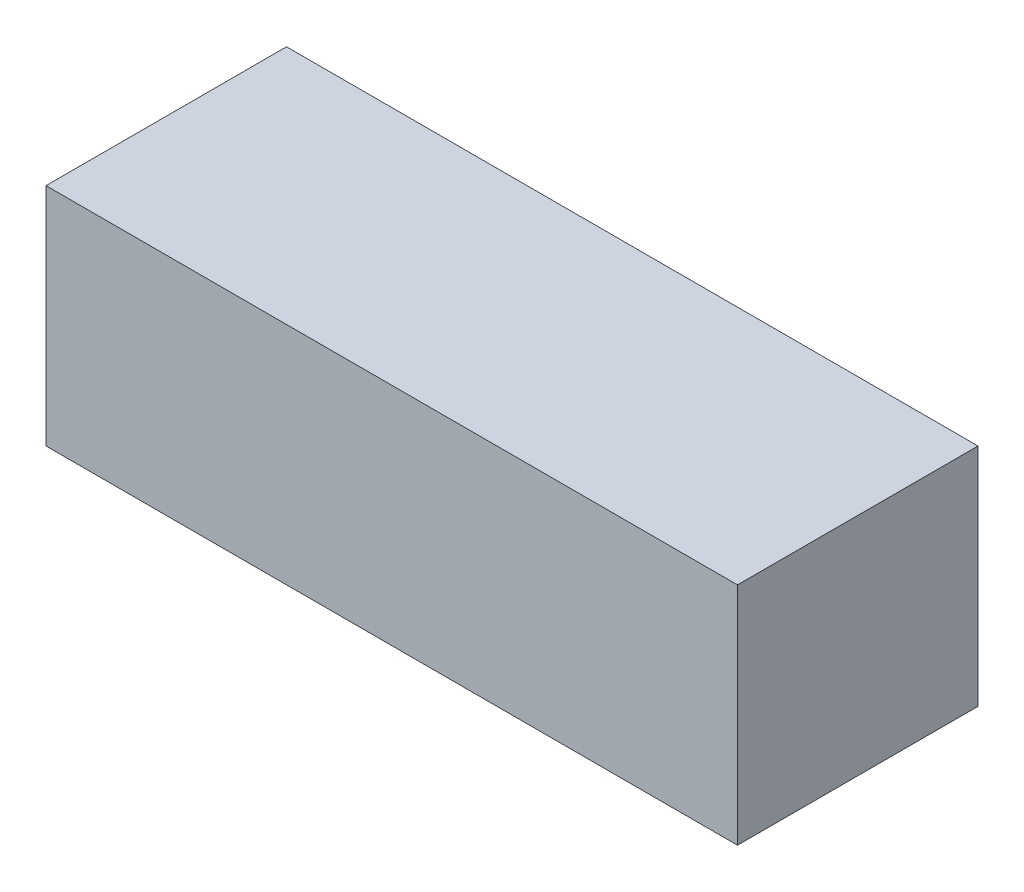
from build123d import *

# Parameters (mm, degrees)
SKETCH1_W           = 230
SKETCH1_H           = 115
BOSS_EXTRUDE1_DEPTH = 37.5
SKETCH2_W           = 230
SKETCH2_H           = 75
CUT_EXTRUDE1_DEPTH  = 35


with BuildPart() as part:
    # Sketch1 → Boss-Extrude1 (new, symmetric)
    with BuildSketch(Plane(origin=(0, 0, 0), x_dir=(1, 0, 0), z_dir=(0, 1, 0))):
        Rectangle(SKETCH1_W, SKETCH1_H)
    extrude(amount=BOSS_EXTRUDE1_DEPTH, both=True)

    # Sketch2 → Cut-Extrude1 (cut)
    with BuildSketch(Plane(origin=(0, 0, -57.5), x_dir=(-1, 0, 0), z_dir=(0, 0, -1))):
        Rectangle(SKETCH2_W, SKETCH2_H)
    extrude(amount=-CUT_EXTRUDE1_DEPTH, mode=Mode.SUBTRACT)


solid = part.part
